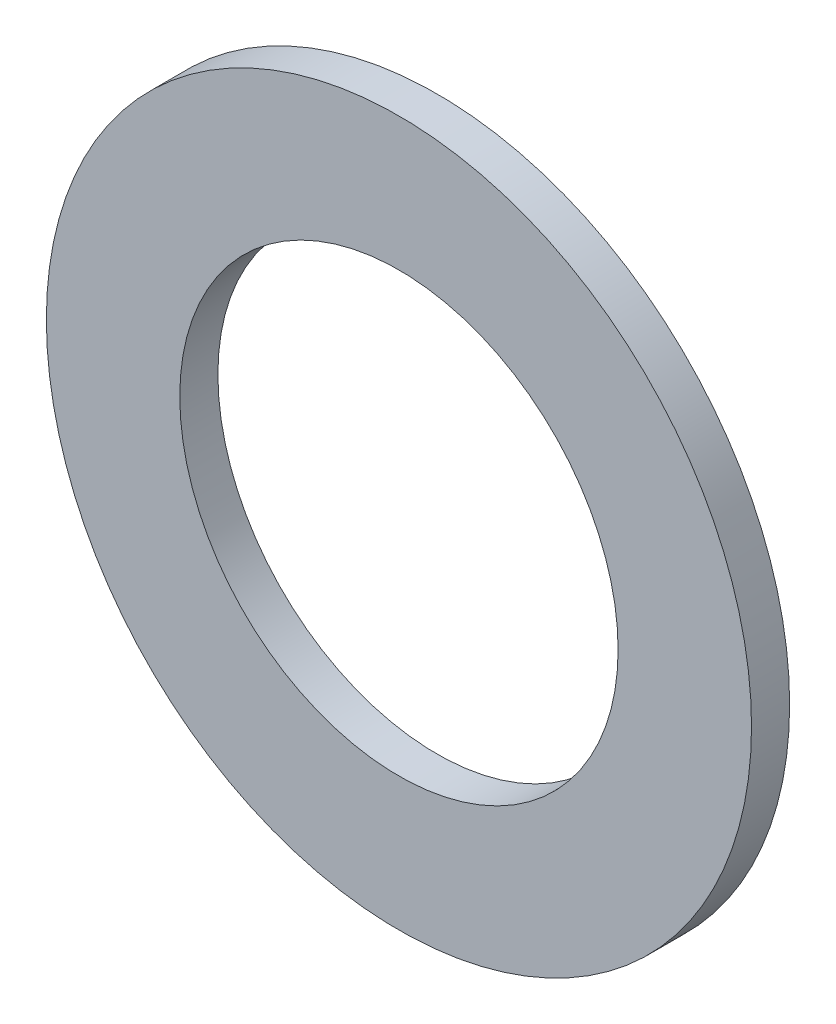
from build123d import *

# Parameters (mm, degrees)
ESQUISSE1_R      = 18.5
ESQUISSE1_R_2    = 11.5
EXTRUSION1_DEPTH = 2


with BuildPart() as part:
    # Esquisse1 → Extrusion1 (new body)
    with BuildSketch(Plane.XY):
        Circle(ESQUISSE1_R)
        Circle(ESQUISSE1_R_2, mode=Mode.SUBTRACT)
    extrude(amount=EXTRUSION1_DEPTH)


solid = part.part
